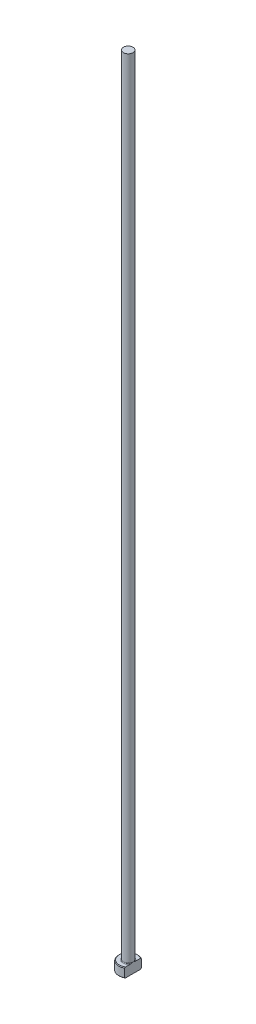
from build123d import *
from build123d.topology import SkipClean

# Parameters (mm, degrees)
CHAMFER1_SIZE = 0.2
FILLET1_R     = 0.2
KEY_DEPTH     = 251.035997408


with BuildPart() as part:
    # Sketch1 → Revolve1 (revolve)
    with BuildSketch(Plane.XY, mode=Mode.PRIVATE) as revolve1_sk:
        Polygon((0, 0), (-3, 0), (-3, 3), (-1.5, 3), (-1.5, 250), (0, 250), align=None)
    revolve(revolve1_sk.sketch.rotate(Axis((0, 259.958771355, 0), (0, -1, 0)), 270), axis=Axis((0, 259.958771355, 0), (0, -1, 0)))

    # Chamfer1
    chamfer1_edges = [part.edges().sort_by_distance(p)[0] for p in [
        (0, 3, -3),
        (0, 0, -3),
    ]]
    chamfer(chamfer1_edges, length=CHAMFER1_SIZE)

    # Fillet1
    fillet1_edges = [part.edges().sort_by_distance(p)[0] for p in [
        (0, 3, -1.5),
    ]]
    fillet(fillet1_edges, radius=FILLET1_R)

    # Sketch2 → KEY (cut, through all)
    with SkipClean():  # the faces are left unmerged after this step: merging them gives an invalid solid
        with BuildSketch(Plane(origin=(0, 0, 0), x_dir=(1, 0, 0), z_dir=(0, 1, 0))):
            with BuildLine():
                Line((1.5, 2.598076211), (1.5, -2.598076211))
                ThreePointArc((1.5, -2.598076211), (3, 0), (1.5, 2.598076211))
            make_face()
        extrude(amount=KEY_DEPTH, mode=Mode.SUBTRACT)


solid = part.part
